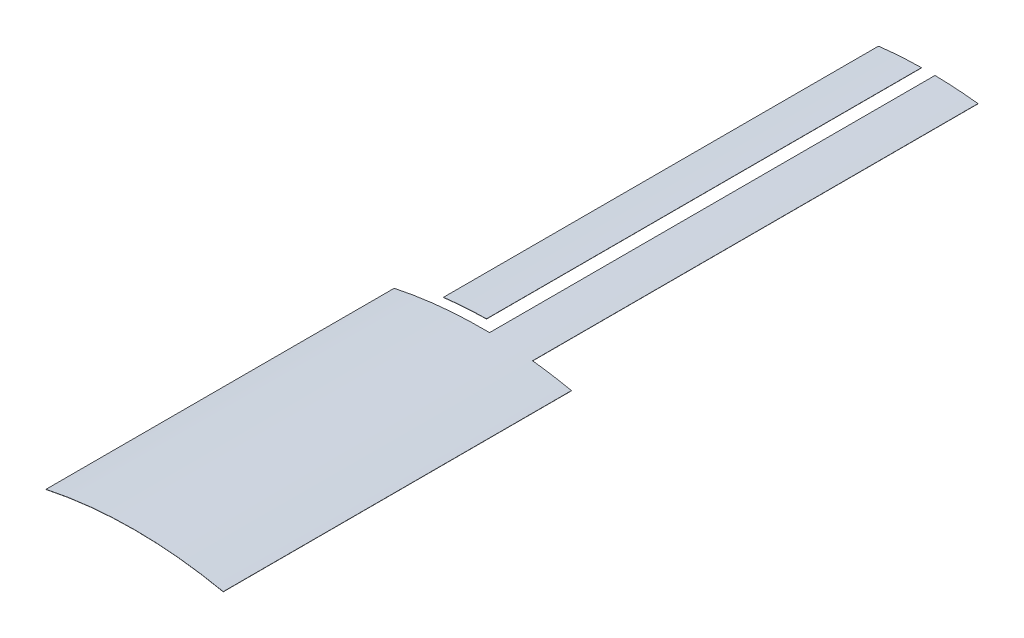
ISO-10303-21;
HEADER;
FILE_DESCRIPTION(('STEP AP214'),'2;1');
FILE_NAME('part.step','',(''),(''),'','','');
FILE_SCHEMA(('AUTOMOTIVE_DESIGN { 1 0 10303 214 1 1 1 1 }'));
ENDSEC;
DATA;
#1=APPLICATION_CONTEXT('core data for automotive mechanical design processes');
#2=APPLICATION_PROTOCOL_DEFINITION('international standard','automotive_design',2000,#1);
#3=PRODUCT_CONTEXT('',#1,'mechanical');
#4=PRODUCT('Part','Part','',(#3));
#5=PRODUCT_RELATED_PRODUCT_CATEGORY('part','',(#4));
#6=PRODUCT_DEFINITION_FORMATION('','',#4);
#7=PRODUCT_DEFINITION_CONTEXT('part definition',#1,'design');
#8=PRODUCT_DEFINITION('design','',#6,#7);
#9=PRODUCT_DEFINITION_SHAPE('','',#8);
#10=(LENGTH_UNIT() NAMED_UNIT(*) SI_UNIT(.MILLI.,.METRE.));
#11=(NAMED_UNIT(*) PLANE_ANGLE_UNIT() SI_UNIT($,.RADIAN.));
#12=(NAMED_UNIT(*) SI_UNIT($,.STERADIAN.) SOLID_ANGLE_UNIT());
#13=UNCERTAINTY_MEASURE_WITH_UNIT(LENGTH_MEASURE(1.E-05),#10,'distance_accuracy_value','');
#14=(GEOMETRIC_REPRESENTATION_CONTEXT(3) GLOBAL_UNCERTAINTY_ASSIGNED_CONTEXT((#13)) GLOBAL_UNIT_ASSIGNED_CONTEXT((#10,
#11,#12)) REPRESENTATION_CONTEXT('',''));
#15=CARTESIAN_POINT('',(0.,0.,0.));
#16=DIRECTION('',(0.,0.,1.));
#17=DIRECTION('',(1.,0.,0.));
#18=AXIS2_PLACEMENT_3D('',#15,#16,#17);
#19=CARTESIAN_POINT('',(0.,0.,50.8));
#20=DIRECTION('',(0.,0.,-1.));
#21=DIRECTION('',(-1.,0.,0.));
#22=AXIS2_PLACEMENT_3D('',#19,#20,#21);
#23=CYLINDRICAL_SURFACE('',#22,26.8605);
#24=DIRECTION('',(0.,0.,-1.));
#25=VECTOR('',#24,1.);
#26=CARTESIAN_POINT('',(-3.13740719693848,26.6766402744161,50.8));
#27=LINE('',#26,#25);
#28=CARTESIAN_POINT('',(-3.13740719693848,26.6766402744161,27.4249252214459));
#29=VERTEX_POINT('',#28);
#30=CARTESIAN_POINT('',(-3.13740719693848,26.6766402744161,0.));
#31=VERTEX_POINT('',#30);
#32=EDGE_CURVE('E84',#29,#31,#27,.T.);
#33=ORIENTED_EDGE('',*,*,#32,.F.);
#34=CARTESIAN_POINT('',(0.,0.,27.4249252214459));
#35=DIRECTION('',(0.,0.,-1.));
#36=DIRECTION('',(-1.,0.,0.));
#37=AXIS2_PLACEMENT_3D('',#34,#35,#36);
#38=CIRCLE('',#37,26.8605);
#39=CARTESIAN_POINT('',(-0.424685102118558,26.8571424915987,27.4249252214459));
#40=VERTEX_POINT('',#39);
#41=EDGE_CURVE('E76',#29,#40,#38,.T.);
#42=ORIENTED_EDGE('',*,*,#41,.T.);
#43=DIRECTION('',(0.,0.,-1.));
#44=VECTOR('',#43,1.);
#45=CARTESIAN_POINT('',(-0.424685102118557,26.8571424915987,50.8));
#46=LINE('',#45,#44);
#47=CARTESIAN_POINT('',(-0.424685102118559,26.8571424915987,0.));
#48=VERTEX_POINT('',#47);
#49=EDGE_CURVE('E56',#40,#48,#46,.T.);
#50=ORIENTED_EDGE('',*,*,#49,.T.);
#51=CARTESIAN_POINT('',(0.,0.,0.));
#52=DIRECTION('',(0.,0.,1.));
#53=DIRECTION('',(-1.,0.,0.));
#54=AXIS2_PLACEMENT_3D('',#51,#52,#53);
#55=CIRCLE('',#54,26.8605);
#56=EDGE_CURVE('E108',#48,#31,#55,.T.);
#57=ORIENTED_EDGE('',*,*,#56,.T.);
#58=EDGE_LOOP('',(#33,#42,#50,#57));
#59=FACE_BOUND('',#58,.T.);
#60=ADVANCED_FACE('F41',(#59),#23,.T.);
#61=CARTESIAN_POINT('',(0.,0.,50.8));
#62=DIRECTION('',(0.,0.,-1.));
#63=DIRECTION('',(-1.,0.,0.));
#64=AXIS2_PLACEMENT_3D('',#61,#62,#63);
#65=CYLINDRICAL_SURFACE('',#64,26.8478);
#66=DIRECTION('',(0.,0.,-1.));
#67=VECTOR('',#66,1.);
#68=CARTESIAN_POINT('',(-3.13740719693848,26.6638527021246,50.8));
#69=LINE('',#68,#67);
#70=CARTESIAN_POINT('',(-3.13740719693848,26.6638527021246,0.));
#71=VERTEX_POINT('',#70);
#72=CARTESIAN_POINT('',(-3.13740719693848,26.6638527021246,27.4249252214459));
#73=VERTEX_POINT('',#72);
#74=EDGE_CURVE('E89',#71,#73,#69,.F.);
#75=ORIENTED_EDGE('',*,*,#74,.F.);
#76=CARTESIAN_POINT('',(0.,0.,0.));
#77=DIRECTION('',(0.,0.,-1.));
#78=DIRECTION('',(1.,0.,0.));
#79=AXIS2_PLACEMENT_3D('',#76,#77,#78);
#80=CIRCLE('',#79,26.8478);
#81=CARTESIAN_POINT('',(-0.424685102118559,26.8444409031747,0.));
#82=VERTEX_POINT('',#81);
#83=EDGE_CURVE('E44',#71,#82,#80,.T.);
#84=ORIENTED_EDGE('',*,*,#83,.T.);
#85=DIRECTION('',(0.,0.,-1.));
#86=VECTOR('',#85,1.);
#87=CARTESIAN_POINT('',(-0.424685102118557,26.8444409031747,50.8));
#88=LINE('',#87,#86);
#89=CARTESIAN_POINT('',(-0.424685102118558,26.8444409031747,27.4249252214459));
#90=VERTEX_POINT('',#89);
#91=EDGE_CURVE('E101',#82,#90,#88,.F.);
#92=ORIENTED_EDGE('',*,*,#91,.T.);
#93=CARTESIAN_POINT('',(0.,0.,27.4249252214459));
#94=DIRECTION('',(0.,0.,-1.));
#95=DIRECTION('',(-1.,0.,0.));
#96=AXIS2_PLACEMENT_3D('',#93,#94,#95);
#97=CIRCLE('',#96,26.8478);
#98=EDGE_CURVE('E72',#90,#73,#97,.F.);
#99=ORIENTED_EDGE('',*,*,#98,.T.);
#100=EDGE_LOOP('',(#75,#84,#92,#99));
#101=FACE_BOUND('',#100,.T.);
#102=ADVANCED_FACE('F100',(#101),#65,.F.);
#103=CARTESIAN_POINT('',(0.,0.,0.));
#104=DIRECTION('',(0.,0.,-1.));
#105=DIRECTION('',(-1.,0.,0.));
#106=AXIS2_PLACEMENT_3D('',#103,#104,#105);
#107=PLANE('',#106);
#108=ORIENTED_EDGE('',*,*,#83,.F.);
#109=DIRECTION('',(0.,1.,0.));
#110=VECTOR('',#109,1.);
#111=CARTESIAN_POINT('',(-3.13740719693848,0.,0.));
#112=LINE('',#111,#110);
#113=EDGE_CURVE('E92',#71,#31,#112,.T.);
#114=ORIENTED_EDGE('',*,*,#113,.T.);
#115=ORIENTED_EDGE('',*,*,#56,.F.);
#116=DIRECTION('',(0.,1.,0.));
#117=VECTOR('',#116,1.);
#118=CARTESIAN_POINT('',(-0.424685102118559,0.,0.));
#119=LINE('',#118,#117);
#120=EDGE_CURVE('E12',#82,#48,#119,.T.);
#121=ORIENTED_EDGE('',*,*,#120,.F.);
#122=EDGE_LOOP('',(#108,#114,#115,#121));
#123=FACE_BOUND('',#122,.T.);
#124=ADVANCED_FACE('F114',(#123),#107,.T.);
#125=CARTESIAN_POINT('',(0.,50.8,27.4249252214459));
#126=DIRECTION('',(0.,0.,-1.));
#127=DIRECTION('',(-1.,0.,0.));
#128=AXIS2_PLACEMENT_3D('',#125,#126,#127);
#129=PLANE('',#128);
#130=DIRECTION('',(0.,-1.,0.));
#131=VECTOR('',#130,1.);
#132=CARTESIAN_POINT('',(-3.13740719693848,50.8,27.4249252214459));
#133=LINE('',#132,#131);
#134=EDGE_CURVE('E91',#29,#73,#133,.T.);
#135=ORIENTED_EDGE('',*,*,#134,.T.);
#136=ORIENTED_EDGE('',*,*,#98,.F.);
#137=DIRECTION('',(0.,-1.,0.));
#138=VECTOR('',#137,1.);
#139=CARTESIAN_POINT('',(-0.424685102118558,50.8,27.4249252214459));
#140=LINE('',#139,#138);
#141=EDGE_CURVE('E49',#40,#90,#140,.T.);
#142=ORIENTED_EDGE('',*,*,#141,.F.);
#143=ORIENTED_EDGE('',*,*,#41,.F.);
#144=EDGE_LOOP('',(#135,#136,#142,#143));
#145=FACE_BOUND('',#144,.T.);
#146=ADVANCED_FACE('F97',(#145),#129,.F.);
#147=CARTESIAN_POINT('',(-3.13740719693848,50.8,-18.0519492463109));
#148=DIRECTION('',(-1.,0.,0.));
#149=DIRECTION('',(0.,0.,1.));
#150=AXIS2_PLACEMENT_3D('',#147,#148,#149);
#151=PLANE('',#150);
#152=ORIENTED_EDGE('',*,*,#32,.T.);
#153=ORIENTED_EDGE('',*,*,#113,.F.);
#154=ORIENTED_EDGE('',*,*,#74,.T.);
#155=ORIENTED_EDGE('',*,*,#134,.F.);
#156=EDGE_LOOP('',(#152,#153,#154,#155));
#157=FACE_BOUND('',#156,.T.);
#158=ADVANCED_FACE('F90',(#157),#151,.T.);
#159=CARTESIAN_POINT('',(-0.42468510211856,50.8,-18.0519492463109));
#160=DIRECTION('',(-1.,0.,0.));
#161=DIRECTION('',(0.,0.,1.));
#162=AXIS2_PLACEMENT_3D('',#159,#160,#161);
#163=PLANE('',#162);
#164=ORIENTED_EDGE('',*,*,#141,.T.);
#165=ORIENTED_EDGE('',*,*,#91,.F.);
#166=ORIENTED_EDGE('',*,*,#120,.T.);
#167=ORIENTED_EDGE('',*,*,#49,.F.);
#168=EDGE_LOOP('',(#164,#165,#166,#167));
#169=FACE_BOUND('',#168,.T.);
#170=ADVANCED_FACE('F148',(#169),#163,.F.);
#171=CLOSED_SHELL('',(#60,#102,#124,#146,#158,#170));
#172=MANIFOLD_SOLID_BREP('B2',#171);
#173=CARTESIAN_POINT('',(0.,0.,0.));
#174=DIRECTION('',(0.,0.,-1.));
#175=DIRECTION('',(-1.,0.,0.));
#176=AXIS2_PLACEMENT_3D('',#173,#174,#175);
#177=PLANE('',#176);
#178=CARTESIAN_POINT('',(0.,0.,0.));
#179=DIRECTION('',(0.,0.,-1.));
#180=DIRECTION('',(1.,0.,0.));
#181=AXIS2_PLACEMENT_3D('',#178,#179,#180);
#182=CIRCLE('',#181,26.8478);
#183=CARTESIAN_POINT('',(0.424685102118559,26.8444409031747,0.));
#184=VERTEX_POINT('',#183);
#185=CARTESIAN_POINT('',(3.13740719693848,26.6638527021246,0.));
#186=VERTEX_POINT('',#185);
#187=EDGE_CURVE('E169',#184,#186,#182,.T.);
#188=ORIENTED_EDGE('',*,*,#187,.F.);
#189=DIRECTION('',(0.,1.,0.));
#190=VECTOR('',#189,1.);
#191=CARTESIAN_POINT('',(0.424685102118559,0.,0.));
#192=LINE('',#191,#190);
#193=CARTESIAN_POINT('',(0.424685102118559,26.8571424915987,0.));
#194=VERTEX_POINT('',#193);
#195=EDGE_CURVE('E251',#184,#194,#192,.T.);
#196=ORIENTED_EDGE('',*,*,#195,.T.);
#197=CARTESIAN_POINT('',(0.,0.,0.));
#198=DIRECTION('',(0.,0.,1.));
#199=DIRECTION('',(-1.,0.,0.));
#200=AXIS2_PLACEMENT_3D('',#197,#198,#199);
#201=CIRCLE('',#200,26.8605);
#202=CARTESIAN_POINT('',(3.13740719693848,26.6766402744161,0.));
#203=VERTEX_POINT('',#202);
#204=EDGE_CURVE('E244',#203,#194,#201,.T.);
#205=ORIENTED_EDGE('',*,*,#204,.F.);
#206=DIRECTION('',(0.,1.,0.));
#207=VECTOR('',#206,1.);
#208=CARTESIAN_POINT('',(3.13740719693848,0.,0.));
#209=LINE('',#208,#207);
#210=EDGE_CURVE('E227',#186,#203,#209,.T.);
#211=ORIENTED_EDGE('',*,*,#210,.F.);
#212=EDGE_LOOP('',(#188,#196,#205,#211));
#213=FACE_BOUND('',#212,.T.);
#214=ADVANCED_FACE('F165',(#213),#177,.T.);
#215=CARTESIAN_POINT('',(0.,0.,50.8));
#216=DIRECTION('',(0.,0.,-1.));
#217=DIRECTION('',(-1.,0.,0.));
#218=AXIS2_PLACEMENT_3D('',#215,#216,#217);
#219=CYLINDRICAL_SURFACE('',#218,26.8478);
#220=DIRECTION('',(0.,0.,-1.));
#221=VECTOR('',#220,1.);
#222=CARTESIAN_POINT('',(0.424685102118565,26.8444409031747,50.8));
#223=LINE('',#222,#221);
#224=CARTESIAN_POINT('',(0.424685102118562,26.8444409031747,28.0845801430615));
#225=VERTEX_POINT('',#224);
#226=EDGE_CURVE('E250',#184,#225,#223,.F.);
#227=ORIENTED_EDGE('',*,*,#226,.F.);
#228=ORIENTED_EDGE('',*,*,#187,.T.);
#229=DIRECTION('',(0.,0.,-1.));
#230=VECTOR('',#229,1.);
#231=CARTESIAN_POINT('',(3.13740719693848,26.6638527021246,50.8));
#232=LINE('',#231,#230);
#233=CARTESIAN_POINT('',(3.13740719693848,26.6638527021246,28.0845801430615));
#234=VERTEX_POINT('',#233);
#235=EDGE_CURVE('E231',#186,#234,#232,.F.);
#236=ORIENTED_EDGE('',*,*,#235,.T.);
#237=CARTESIAN_POINT('',(0.,0.,28.0845801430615));
#238=DIRECTION('',(0.,0.,1.));
#239=DIRECTION('',(1.,0.,0.));
#240=AXIS2_PLACEMENT_3D('',#237,#238,#239);
#241=CIRCLE('',#240,26.8478);
#242=CARTESIAN_POINT('',(5.588,26.2598290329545,28.0845801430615));
#243=VERTEX_POINT('',#242);
#244=EDGE_CURVE('E237',#234,#243,#241,.F.);
#245=ORIENTED_EDGE('',*,*,#244,.T.);
#246=DIRECTION('',(0.,0.,-1.));
#247=VECTOR('',#246,1.);
#248=CARTESIAN_POINT('',(5.588,26.2598290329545,50.8));
#249=LINE('',#248,#247);
#250=CARTESIAN_POINT('',(5.588,26.2598290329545,50.038));
#251=VERTEX_POINT('',#250);
#252=EDGE_CURVE('E261',#243,#251,#249,.F.);
#253=ORIENTED_EDGE('',*,*,#252,.T.);
#254=CARTESIAN_POINT('',(0.,0.,50.038));
#255=DIRECTION('',(0.,0.,1.));
#256=DIRECTION('',(1.,0.,0.));
#257=AXIS2_PLACEMENT_3D('',#254,#255,#256);
#258=CIRCLE('',#257,26.8478);
#259=CARTESIAN_POINT('',(-5.588,26.2598290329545,50.038));
#260=VERTEX_POINT('',#259);
#261=EDGE_CURVE('E278',#260,#251,#258,.F.);
#262=ORIENTED_EDGE('',*,*,#261,.F.);
#263=DIRECTION('',(0.,0.,-1.));
#264=VECTOR('',#263,1.);
#265=CARTESIAN_POINT('',(-5.588,26.2598290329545,50.8));
#266=LINE('',#265,#264);
#267=CARTESIAN_POINT('',(-5.588,26.2598290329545,28.0845801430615));
#268=VERTEX_POINT('',#267);
#269=EDGE_CURVE('E265',#268,#260,#266,.F.);
#270=ORIENTED_EDGE('',*,*,#269,.F.);
#271=CARTESIAN_POINT('',(0.,0.,28.0845801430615));
#272=DIRECTION('',(0.,0.,-1.));
#273=DIRECTION('',(-1.,0.,0.));
#274=AXIS2_PLACEMENT_3D('',#271,#272,#273);
#275=CIRCLE('',#274,26.8478);
#276=EDGE_CURVE('E269',#225,#268,#275,.F.);
#277=ORIENTED_EDGE('',*,*,#276,.F.);
#278=EDGE_LOOP('',(#227,#228,#236,#245,#253,#262,#270,#277));
#279=FACE_BOUND('',#278,.T.);
#280=ADVANCED_FACE('F248',(#279),#219,.F.);
#281=CARTESIAN_POINT('',(0.,0.,50.8));
#282=DIRECTION('',(0.,0.,-1.));
#283=DIRECTION('',(-1.,0.,0.));
#284=AXIS2_PLACEMENT_3D('',#281,#282,#283);
#285=CYLINDRICAL_SURFACE('',#284,26.8605);
#286=DIRECTION('',(0.,0.,-1.));
#287=VECTOR('',#286,1.);
#288=CARTESIAN_POINT('',(0.424685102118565,26.8571424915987,50.8));
#289=LINE('',#288,#287);
#290=CARTESIAN_POINT('',(0.424685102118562,26.8571424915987,28.0845801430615));
#291=VERTEX_POINT('',#290);
#292=EDGE_CURVE('E245',#291,#194,#289,.T.);
#293=ORIENTED_EDGE('',*,*,#292,.F.);
#294=CARTESIAN_POINT('',(0.,0.,28.0845801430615));
#295=DIRECTION('',(0.,0.,-1.));
#296=DIRECTION('',(-1.,0.,0.));
#297=AXIS2_PLACEMENT_3D('',#294,#295,#296);
#298=CIRCLE('',#297,26.8605);
#299=CARTESIAN_POINT('',(-5.588,26.2728132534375,28.0845801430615));
#300=VERTEX_POINT('',#299);
#301=EDGE_CURVE('E270',#300,#291,#298,.T.);
#302=ORIENTED_EDGE('',*,*,#301,.F.);
#303=DIRECTION('',(0.,0.,-1.));
#304=VECTOR('',#303,1.);
#305=CARTESIAN_POINT('',(-5.588,26.2728132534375,50.8));
#306=LINE('',#305,#304);
#307=CARTESIAN_POINT('',(-5.588,26.2728132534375,50.038));
#308=VERTEX_POINT('',#307);
#309=EDGE_CURVE('E266',#308,#300,#306,.T.);
#310=ORIENTED_EDGE('',*,*,#309,.F.);
#311=CARTESIAN_POINT('',(0.,0.,50.038));
#312=DIRECTION('',(0.,0.,1.));
#313=DIRECTION('',(1.,0.,0.));
#314=AXIS2_PLACEMENT_3D('',#311,#312,#313);
#315=CIRCLE('',#314,26.8605);
#316=CARTESIAN_POINT('',(5.588,26.2728132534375,50.038));
#317=VERTEX_POINT('',#316);
#318=EDGE_CURVE('E262',#317,#308,#315,.T.);
#319=ORIENTED_EDGE('',*,*,#318,.F.);
#320=DIRECTION('',(0.,0.,-1.));
#321=VECTOR('',#320,1.);
#322=CARTESIAN_POINT('',(5.588,26.2728132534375,50.8));
#323=LINE('',#322,#321);
#324=CARTESIAN_POINT('',(5.588,26.2728132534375,28.0845801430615));
#325=VERTEX_POINT('',#324);
#326=EDGE_CURVE('E258',#317,#325,#323,.T.);
#327=ORIENTED_EDGE('',*,*,#326,.T.);
#328=CARTESIAN_POINT('',(0.,0.,28.0845801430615));
#329=DIRECTION('',(0.,0.,1.));
#330=DIRECTION('',(1.,0.,0.));
#331=AXIS2_PLACEMENT_3D('',#328,#329,#330);
#332=CIRCLE('',#331,26.8605);
#333=CARTESIAN_POINT('',(3.13740719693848,26.6766402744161,28.0845801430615));
#334=VERTEX_POINT('',#333);
#335=EDGE_CURVE('E183',#325,#334,#332,.T.);
#336=ORIENTED_EDGE('',*,*,#335,.T.);
#337=DIRECTION('',(0.,0.,-1.));
#338=VECTOR('',#337,1.);
#339=CARTESIAN_POINT('',(3.13740719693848,26.6766402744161,50.8));
#340=LINE('',#339,#338);
#341=EDGE_CURVE('E257',#334,#203,#340,.T.);
#342=ORIENTED_EDGE('',*,*,#341,.T.);
#343=ORIENTED_EDGE('',*,*,#204,.T.);
#344=EDGE_LOOP('',(#293,#302,#310,#319,#327,#336,#342,#343));
#345=FACE_BOUND('',#344,.T.);
#346=ADVANCED_FACE('F167',(#345),#285,.T.);
#347=CARTESIAN_POINT('',(3.13740719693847,50.8,-18.0519492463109));
#348=DIRECTION('',(-1.,0.,0.));
#349=DIRECTION('',(0.,0.,1.));
#350=AXIS2_PLACEMENT_3D('',#347,#348,#349);
#351=PLANE('',#350);
#352=DIRECTION('',(0.,-1.,0.));
#353=VECTOR('',#352,1.);
#354=CARTESIAN_POINT('',(3.13740719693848,50.8,28.0845801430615));
#355=LINE('',#354,#353);
#356=EDGE_CURVE('E233',#334,#234,#355,.T.);
#357=ORIENTED_EDGE('',*,*,#356,.T.);
#358=ORIENTED_EDGE('',*,*,#235,.F.);
#359=ORIENTED_EDGE('',*,*,#210,.T.);
#360=ORIENTED_EDGE('',*,*,#341,.F.);
#361=EDGE_LOOP('',(#357,#358,#359,#360));
#362=FACE_BOUND('',#361,.T.);
#363=ADVANCED_FACE('F232',(#362),#351,.F.);
#364=CARTESIAN_POINT('',(0.424685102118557,50.8,-18.0519492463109));
#365=DIRECTION('',(-1.,0.,0.));
#366=DIRECTION('',(0.,0.,1.));
#367=AXIS2_PLACEMENT_3D('',#364,#365,#366);
#368=PLANE('',#367);
#369=ORIENTED_EDGE('',*,*,#292,.T.);
#370=ORIENTED_EDGE('',*,*,#195,.F.);
#371=ORIENTED_EDGE('',*,*,#226,.T.);
#372=DIRECTION('',(0.,-1.,0.));
#373=VECTOR('',#372,1.);
#374=CARTESIAN_POINT('',(0.424685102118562,50.8,28.0845801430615));
#375=LINE('',#374,#373);
#376=EDGE_CURVE('E272',#291,#225,#375,.T.);
#377=ORIENTED_EDGE('',*,*,#376,.F.);
#378=EDGE_LOOP('',(#369,#370,#371,#377));
#379=FACE_BOUND('',#378,.T.);
#380=ADVANCED_FACE('F311',(#379),#368,.T.);
#381=CARTESIAN_POINT('',(0.,50.8,28.0845801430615));
#382=DIRECTION('',(0.,0.,-1.));
#383=DIRECTION('',(-1.,0.,0.));
#384=AXIS2_PLACEMENT_3D('',#381,#382,#383);
#385=PLANE('',#384);
#386=ORIENTED_EDGE('',*,*,#301,.T.);
#387=ORIENTED_EDGE('',*,*,#376,.T.);
#388=ORIENTED_EDGE('',*,*,#276,.T.);
#389=DIRECTION('',(0.,-1.,0.));
#390=VECTOR('',#389,1.);
#391=CARTESIAN_POINT('',(-5.588,50.8,28.0845801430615));
#392=LINE('',#391,#390);
#393=EDGE_CURVE('E268',#300,#268,#392,.T.);
#394=ORIENTED_EDGE('',*,*,#393,.F.);
#395=EDGE_LOOP('',(#386,#387,#388,#394));
#396=FACE_BOUND('',#395,.T.);
#397=ADVANCED_FACE('F297',(#396),#385,.T.);
#398=CARTESIAN_POINT('',(-5.588,50.8,-18.0519492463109));
#399=DIRECTION('',(-1.,0.,0.));
#400=DIRECTION('',(0.,0.,1.));
#401=AXIS2_PLACEMENT_3D('',#398,#399,#400);
#402=PLANE('',#401);
#403=ORIENTED_EDGE('',*,*,#309,.T.);
#404=ORIENTED_EDGE('',*,*,#393,.T.);
#405=ORIENTED_EDGE('',*,*,#269,.T.);
#406=DIRECTION('',(0.,-1.,0.));
#407=VECTOR('',#406,1.);
#408=CARTESIAN_POINT('',(-5.588,50.8,50.038));
#409=LINE('',#408,#407);
#410=EDGE_CURVE('E264',#308,#260,#409,.T.);
#411=ORIENTED_EDGE('',*,*,#410,.F.);
#412=EDGE_LOOP('',(#403,#404,#405,#411));
#413=FACE_BOUND('',#412,.T.);
#414=ADVANCED_FACE('F301',(#413),#402,.T.);
#415=CARTESIAN_POINT('',(0.,50.8,50.038));
#416=DIRECTION('',(0.,0.,1.));
#417=DIRECTION('',(1.,0.,0.));
#418=AXIS2_PLACEMENT_3D('',#415,#416,#417);
#419=PLANE('',#418);
#420=ORIENTED_EDGE('',*,*,#318,.T.);
#421=ORIENTED_EDGE('',*,*,#410,.T.);
#422=ORIENTED_EDGE('',*,*,#261,.T.);
#423=DIRECTION('',(0.,-1.,0.));
#424=VECTOR('',#423,1.);
#425=CARTESIAN_POINT('',(5.588,50.8,50.038));
#426=LINE('',#425,#424);
#427=EDGE_CURVE('E175',#317,#251,#426,.T.);
#428=ORIENTED_EDGE('',*,*,#427,.F.);
#429=EDGE_LOOP('',(#420,#421,#422,#428));
#430=FACE_BOUND('',#429,.T.);
#431=ADVANCED_FACE('F306',(#430),#419,.T.);
#432=CARTESIAN_POINT('',(5.58799999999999,50.8,-18.0519492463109));
#433=DIRECTION('',(-1.,0.,0.));
#434=DIRECTION('',(0.,0.,1.));
#435=AXIS2_PLACEMENT_3D('',#432,#433,#434);
#436=PLANE('',#435);
#437=ORIENTED_EDGE('',*,*,#427,.T.);
#438=ORIENTED_EDGE('',*,*,#252,.F.);
#439=DIRECTION('',(0.,-1.,0.));
#440=VECTOR('',#439,1.);
#441=CARTESIAN_POINT('',(5.588,50.8,28.0845801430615));
#442=LINE('',#441,#440);
#443=EDGE_CURVE('E39',#325,#243,#442,.T.);
#444=ORIENTED_EDGE('',*,*,#443,.F.);
#445=ORIENTED_EDGE('',*,*,#326,.F.);
#446=EDGE_LOOP('',(#437,#438,#444,#445));
#447=FACE_BOUND('',#446,.T.);
#448=ADVANCED_FACE('F309',(#447),#436,.F.);
#449=CARTESIAN_POINT('',(0.,50.8,28.0845801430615));
#450=DIRECTION('',(0.,0.,1.));
#451=DIRECTION('',(1.,0.,0.));
#452=AXIS2_PLACEMENT_3D('',#449,#450,#451);
#453=PLANE('',#452);
#454=ORIENTED_EDGE('',*,*,#443,.T.);
#455=ORIENTED_EDGE('',*,*,#244,.F.);
#456=ORIENTED_EDGE('',*,*,#356,.F.);
#457=ORIENTED_EDGE('',*,*,#335,.F.);
#458=EDGE_LOOP('',(#454,#455,#456,#457));
#459=FACE_BOUND('',#458,.T.);
#460=ADVANCED_FACE('F288',(#459),#453,.F.);
#461=CLOSED_SHELL('',(#214,#280,#346,#363,#380,#397,#414,#431,#448,#460));
#462=MANIFOLD_SOLID_BREP('B6',#461);
#463=ADVANCED_BREP_SHAPE_REPRESENTATION('',(#18,#172,#462),#14);
#464=SHAPE_DEFINITION_REPRESENTATION(#9,#463);
ENDSEC;
END-ISO-10303-21;
